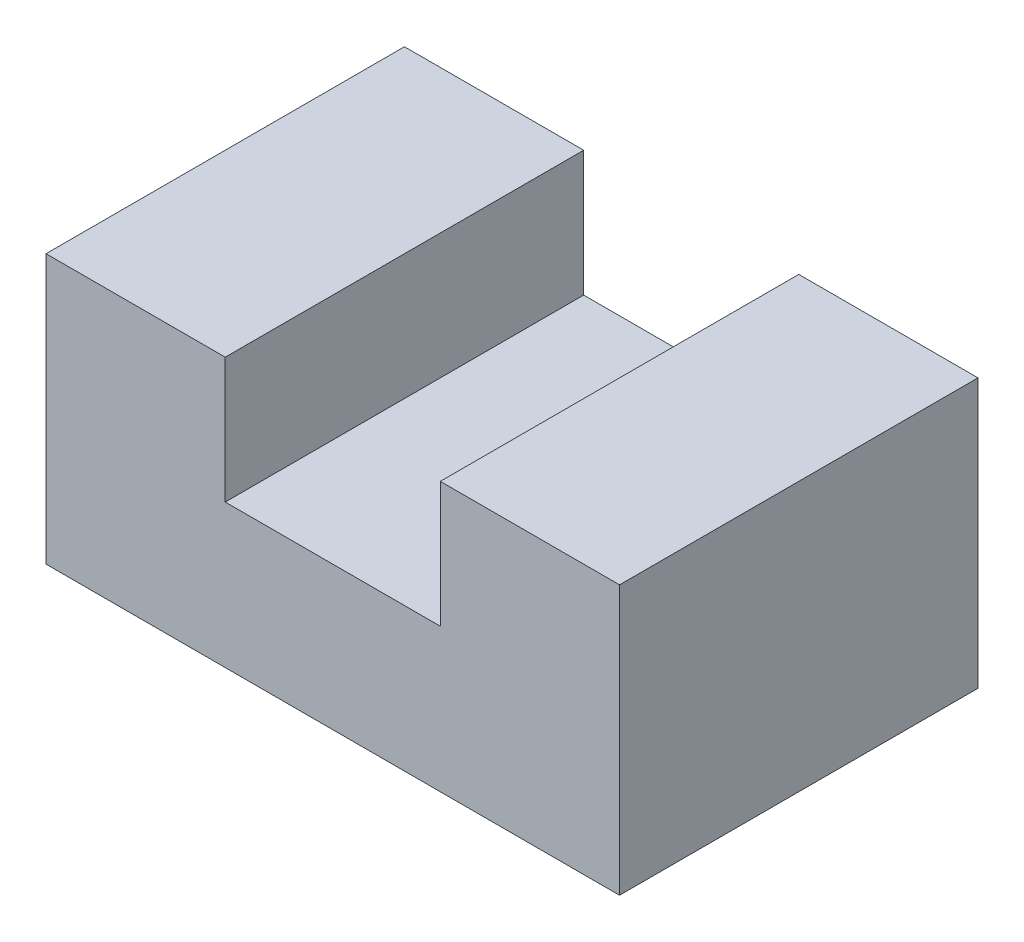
from build123d import *

# Parameters (mm, degrees)
BOSS_EXTRUDE1_DEPTH = 50


with BuildPart() as part:
    # Sketch1 → Boss-Extrude1 (new, symmetric)
    with BuildSketch(Plane.XY):
        Polygon((-80, 0), (80, 0), (80, 75), (30, 75), (30, 40), (-30, 40), (-30, 75), (-80, 75), align=None)
    extrude(amount=BOSS_EXTRUDE1_DEPTH, both=True)


solid = part.part
